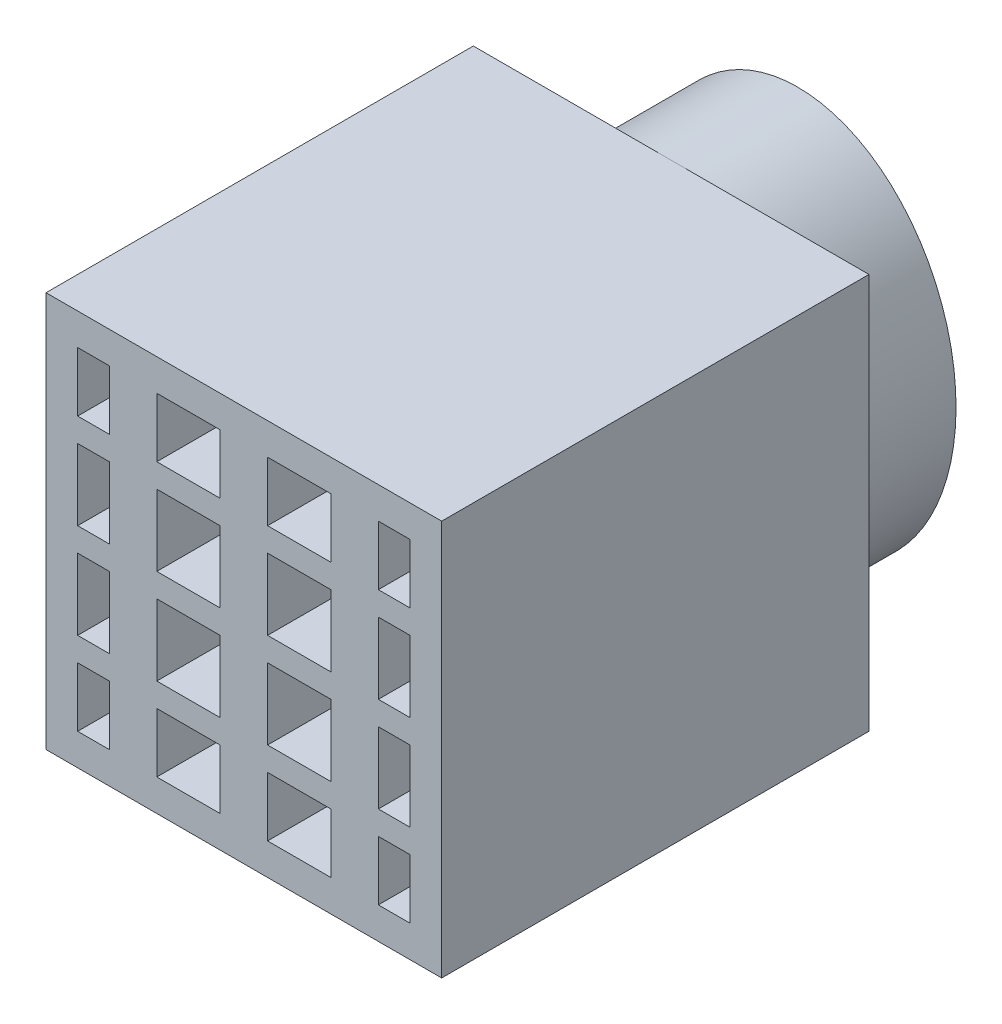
from build123d import *

# Parameters (mm, degrees)
SKETCH_8_W       = 25
SKETCH_8_H       = 25
SKETCH_8_W_2     = 4
SKETCH_8_H_2     = 21
SKETCH_8_W_3     = 2
EXTRUDE_7_DEPTH  = 25
SKETCH_9_W       = 25
SKETCH_9_H       = 25
EXTRUDE_8_DEPTH  = 2
SKETCH_14_W      = 25
SKETCH_14_H      = 1.5
EXTRUDE_11_DEPTH = 25
SKETCH_16_RX     = 12.5
SKETCH_16_RY     = 10
SKETCH_16_RX_2   = 10.5
SKETCH_16_RY_2   = 8
EXTRUDE_14_DEPTH = 6
SKETCH_22_RX     = 12.5
SKETCH_22_RY     = 10
EXTRUDE_18_DEPTH = 2


with BuildPart() as part:
    # Sketch 8 → Extrude 7 (new body)
    with BuildSketch(Plane.XY):
        Rectangle(SKETCH_8_W, SKETCH_8_H)
        with Locations((3.5, 0)):
            Rectangle(SKETCH_8_W_2, SKETCH_8_H_2, mode=Mode.SUBTRACT)
        with Locations((-3.5, 0)):
            Rectangle(SKETCH_8_W_2, SKETCH_8_H_2, mode=Mode.SUBTRACT)
        with Locations((-9.5, 0)):
            Rectangle(SKETCH_8_W_3, SKETCH_8_H_2, mode=Mode.SUBTRACT)
        with Locations((9.5, 0)):
            Rectangle(SKETCH_8_W_3, SKETCH_8_H_2, mode=Mode.SUBTRACT)
    extrude(amount=EXTRUDE_7_DEPTH)

    # Sketch 9 → Extrude 8 (add)
    with BuildSketch(Plane(origin=(0, 0, 0), x_dir=(-1, 0, 0), z_dir=(0, 0, -1))):
        Rectangle(SKETCH_9_W, SKETCH_9_H)
    extrude(amount=EXTRUDE_8_DEPTH)

    # Sketch 14 → Extrude 11 (add)
    with BuildSketch(Plane.XY.offset(25)):
        Rectangle(SKETCH_14_W, SKETCH_14_H)
        with Locations((0, 6)):
            Rectangle(SKETCH_14_W, SKETCH_14_H)
        with Locations((0, -6)):
            Rectangle(SKETCH_14_W, SKETCH_14_H)
    extrude(amount=-EXTRUDE_11_DEPTH)

    # Sketch 16 → Extrude 14 (add)
    with BuildSketch(Plane(origin=(0, 0, -2), x_dir=(-1, 0, 0), z_dir=(0, 0, -1))):
        with Locations(Location((0, 0), (0, 0, -90))):
            Ellipse(SKETCH_16_RX, SKETCH_16_RY)
        with Locations(Location((0, 0), (0, 0, -90))):
            Ellipse(SKETCH_16_RX_2, SKETCH_16_RY_2, mode=Mode.SUBTRACT)
    extrude(amount=EXTRUDE_14_DEPTH)

    # Sketch 22 → Extrude 18 (add)
    with BuildSketch(Plane(origin=(0, 0, -8), x_dir=(-1, 0, 0), z_dir=(0, 0, -1))):
        with Locations(Location((0, 0), (0, 0, -90))):
            Ellipse(SKETCH_22_RX, SKETCH_22_RY)
    extrude(amount=EXTRUDE_18_DEPTH)


solid = part.part
